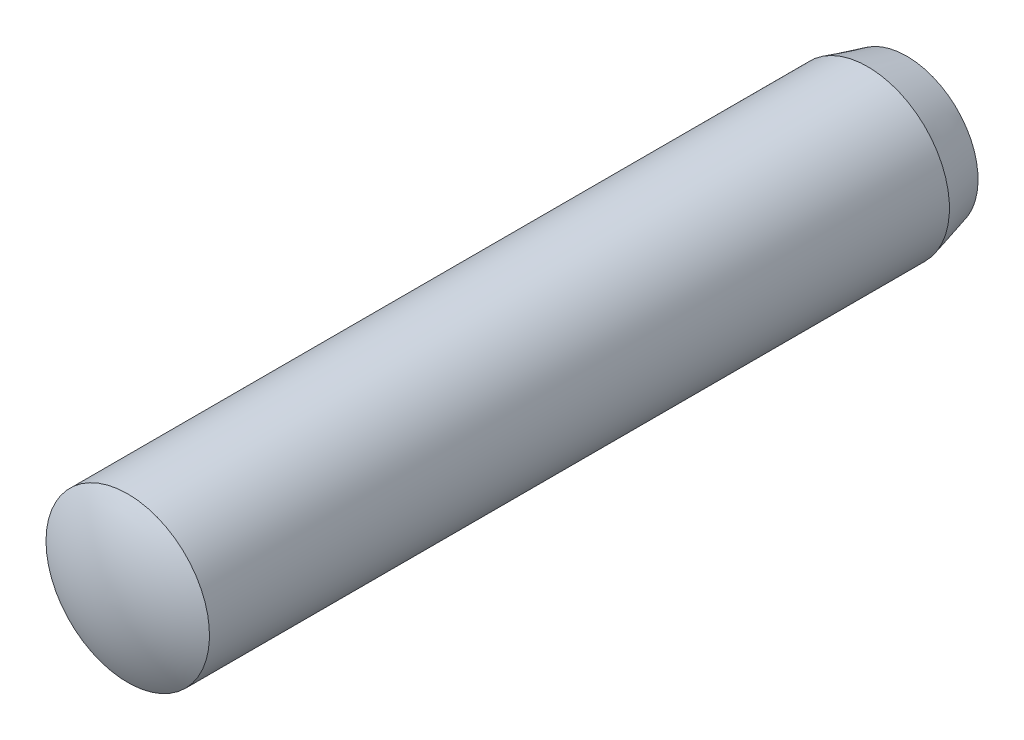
ISO-10303-21;
HEADER;
FILE_DESCRIPTION(('STEP AP214'),'2;1');
FILE_NAME('part.step','',(''),(''),'','','');
FILE_SCHEMA(('AUTOMOTIVE_DESIGN { 1 0 10303 214 1 1 1 1 }'));
ENDSEC;
DATA;
#1=APPLICATION_CONTEXT('core data for automotive mechanical design processes');
#2=APPLICATION_PROTOCOL_DEFINITION('international standard','automotive_design',2000,#1);
#3=PRODUCT_CONTEXT('',#1,'mechanical');
#4=PRODUCT('Part','Part','',(#3));
#5=PRODUCT_RELATED_PRODUCT_CATEGORY('part','',(#4));
#6=PRODUCT_DEFINITION_FORMATION('','',#4);
#7=PRODUCT_DEFINITION_CONTEXT('part definition',#1,'design');
#8=PRODUCT_DEFINITION('design','',#6,#7);
#9=PRODUCT_DEFINITION_SHAPE('','',#8);
#10=(LENGTH_UNIT() NAMED_UNIT(*) SI_UNIT(.MILLI.,.METRE.));
#11=(NAMED_UNIT(*) PLANE_ANGLE_UNIT() SI_UNIT($,.RADIAN.));
#12=(NAMED_UNIT(*) SI_UNIT($,.STERADIAN.) SOLID_ANGLE_UNIT());
#13=UNCERTAINTY_MEASURE_WITH_UNIT(LENGTH_MEASURE(1.E-05),#10,'distance_accuracy_value','');
#14=(GEOMETRIC_REPRESENTATION_CONTEXT(3) GLOBAL_UNCERTAINTY_ASSIGNED_CONTEXT((#13)) GLOBAL_UNIT_ASSIGNED_CONTEXT((#10,
#11,#12)) REPRESENTATION_CONTEXT('',''));
#15=CARTESIAN_POINT('',(0.,0.,0.));
#16=DIRECTION('',(0.,0.,1.));
#17=DIRECTION('',(1.,0.,0.));
#18=AXIS2_PLACEMENT_3D('',#15,#16,#17);
#19=CARTESIAN_POINT('',(0.,0.,-8.00000000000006));
#20=DIRECTION('',(0.,0.,-1.));
#21=DIRECTION('',(0.,1.,0.));
#22=AXIS2_PLACEMENT_3D('',#19,#20,#21);
#23=SPHERICAL_SURFACE('',#22,8.00000000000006);
#24=CARTESIAN_POINT('',(0.,0.,-1.07179676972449));
#25=DIRECTION('',(0.,0.,-1.));
#26=DIRECTION('',(-1.,0.,0.));
#27=AXIS2_PLACEMENT_3D('',#24,#25,#26);
#28=CIRCLE('',#27,4.);
#29=CARTESIAN_POINT('',(-4.,0.,-1.07179676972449));
#30=VERTEX_POINT('',#29);
#31=EDGE_CURVE('E10',#30,#30,#28,.T.);
#32=ORIENTED_EDGE('',*,*,#31,.F.);
#33=EDGE_LOOP('',(#32));
#34=FACE_BOUND('',#33,.T.);
#35=ADVANCED_FACE('F32',(#34),#23,.T.);
#36=CARTESIAN_POINT('',(0.,0.,-40.));
#37=DIRECTION('',(0.,0.,-1.));
#38=DIRECTION('',(-1.,0.,0.));
#39=AXIS2_PLACEMENT_3D('',#36,#37,#38);
#40=CYLINDRICAL_SURFACE('',#39,4.);
#41=ORIENTED_EDGE('',*,*,#31,.T.);
#42=EDGE_LOOP('',(#41));
#43=FACE_BOUND('',#42,.T.);
#44=CARTESIAN_POINT('',(0.,0.,-37.2859026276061));
#45=DIRECTION('',(0.,0.,-1.));
#46=DIRECTION('',(-1.,0.,0.));
#47=AXIS2_PLACEMENT_3D('',#44,#45,#46);
#48=CIRCLE('',#47,4.);
#49=CARTESIAN_POINT('',(-4.,0.,-37.2859026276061));
#50=VERTEX_POINT('',#49);
#51=EDGE_CURVE('E38',#50,#50,#48,.T.);
#52=ORIENTED_EDGE('',*,*,#51,.F.);
#53=EDGE_LOOP('',(#52));
#54=FACE_BOUND('',#53,.T.);
#55=ADVANCED_FACE('F53',(#43,#54),#40,.T.);
#56=CARTESIAN_POINT('',(0.,0.,-39.2));
#57=DIRECTION('',(0.,0.,1.));
#58=DIRECTION('',(1.,0.,0.));
#59=AXIS2_PLACEMENT_3D('',#56,#57,#58);
#60=CONICAL_SURFACE('',#59,3.48711915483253,0.261799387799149);
#61=ORIENTED_EDGE('',*,*,#51,.T.);
#62=EDGE_LOOP('',(#61));
#63=FACE_BOUND('',#62,.T.);
#64=CARTESIAN_POINT('',(0.,0.,-39.2));
#65=DIRECTION('',(0.,0.,-1.));
#66=DIRECTION('',(-1.,0.,0.));
#67=AXIS2_PLACEMENT_3D('',#64,#65,#66);
#68=CIRCLE('',#67,3.48711915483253);
#69=CARTESIAN_POINT('',(-3.48711915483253,0.,-39.2));
#70=VERTEX_POINT('',#69);
#71=EDGE_CURVE('E42',#70,#70,#68,.T.);
#72=ORIENTED_EDGE('',*,*,#71,.F.);
#73=EDGE_LOOP('',(#72));
#74=FACE_BOUND('',#73,.T.);
#75=ADVANCED_FACE('F51',(#63,#74),#60,.T.);
#76=CARTESIAN_POINT('',(0.,0.,-31.9999999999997));
#77=DIRECTION('',(0.,0.,-1.));
#78=DIRECTION('',(0.,1.,0.));
#79=AXIS2_PLACEMENT_3D('',#76,#77,#78);
#80=SPHERICAL_SURFACE('',#79,8.00000000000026);
#81=ORIENTED_EDGE('',*,*,#71,.T.);
#82=EDGE_LOOP('',(#81));
#83=FACE_BOUND('',#82,.T.);
#84=ADVANCED_FACE('F49',(#83),#80,.T.);
#85=CLOSED_SHELL('',(#35,#55,#75,#84));
#86=MANIFOLD_SOLID_BREP('B2',#85);
#87=ADVANCED_BREP_SHAPE_REPRESENTATION('',(#18,#86),#14);
#88=SHAPE_DEFINITION_REPRESENTATION(#9,#87);
ENDSEC;
END-ISO-10303-21;
